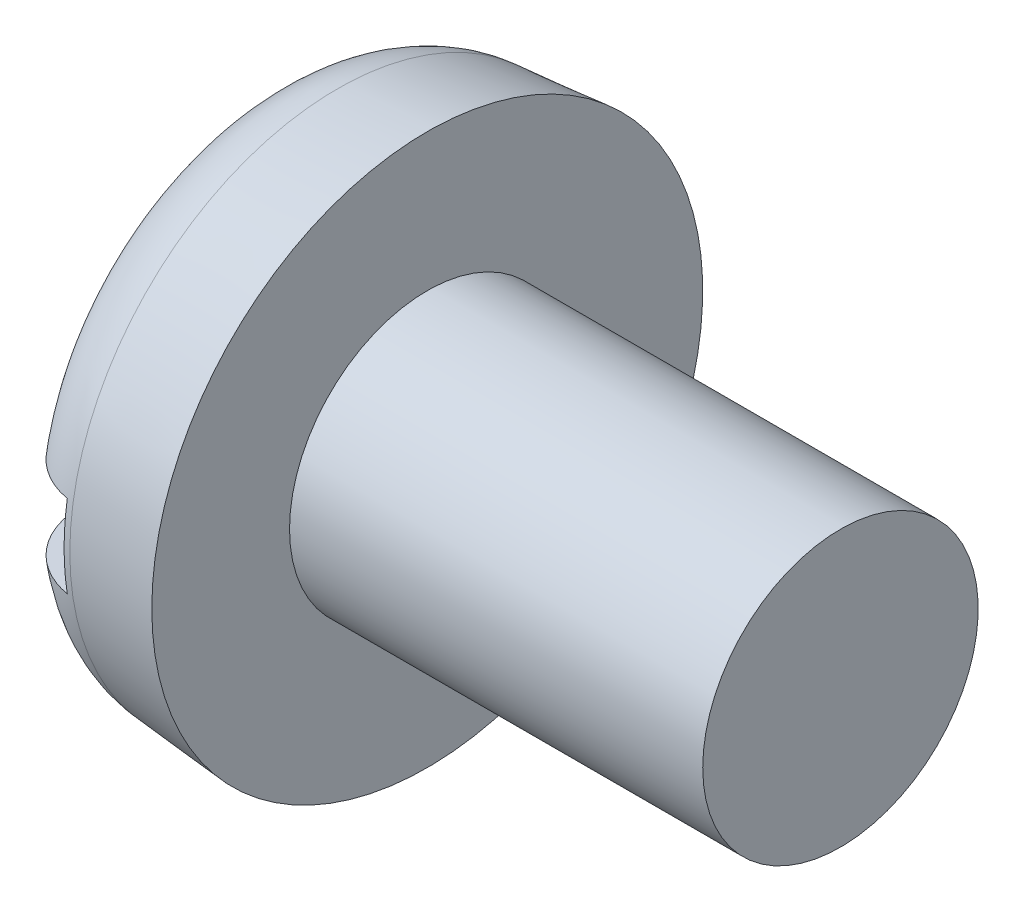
from build123d import *

# Parameters (mm, degrees)
FILLET2_R  = 1.2
SKETCH2_W  = 8
SKETCH2_H  = 1.2
SLOT_DEPTH = 1


with BuildPart() as part:
    # BodySke → Base-Revolve (revolve)
    with BuildSketch(Plane.XY, mode=Mode.PRIVATE) as base_revolve_sk:
        Polygon((2.4, 2), (2.4, 4), (0, 3.790027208), (0, 0), (8.4, 0), (8.4, 2), align=None)
    revolve(base_revolve_sk.sketch.rotate(Axis((-25.4, 0, 0), (1, 0, 0)), 90), axis=Axis((-25.4, 0, 0), (1, 0, 0)))

    # Fillet2
    fillet2_edges = [part.edges().sort_by_distance(p)[0] for p in [
        (0, 0, -3.790027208),
    ]]
    fillet(fillet2_edges, radius=FILLET2_R)

    # Sketch2 → Slot (cut)
    with BuildSketch(Plane(origin=(0, 0, 0), x_dir=(0, 0, -1), z_dir=(1, 0, 0))):
        Rectangle(SKETCH2_W, SKETCH2_H)
    extrude(amount=SLOT_DEPTH, mode=Mode.SUBTRACT)


solid = part.part
